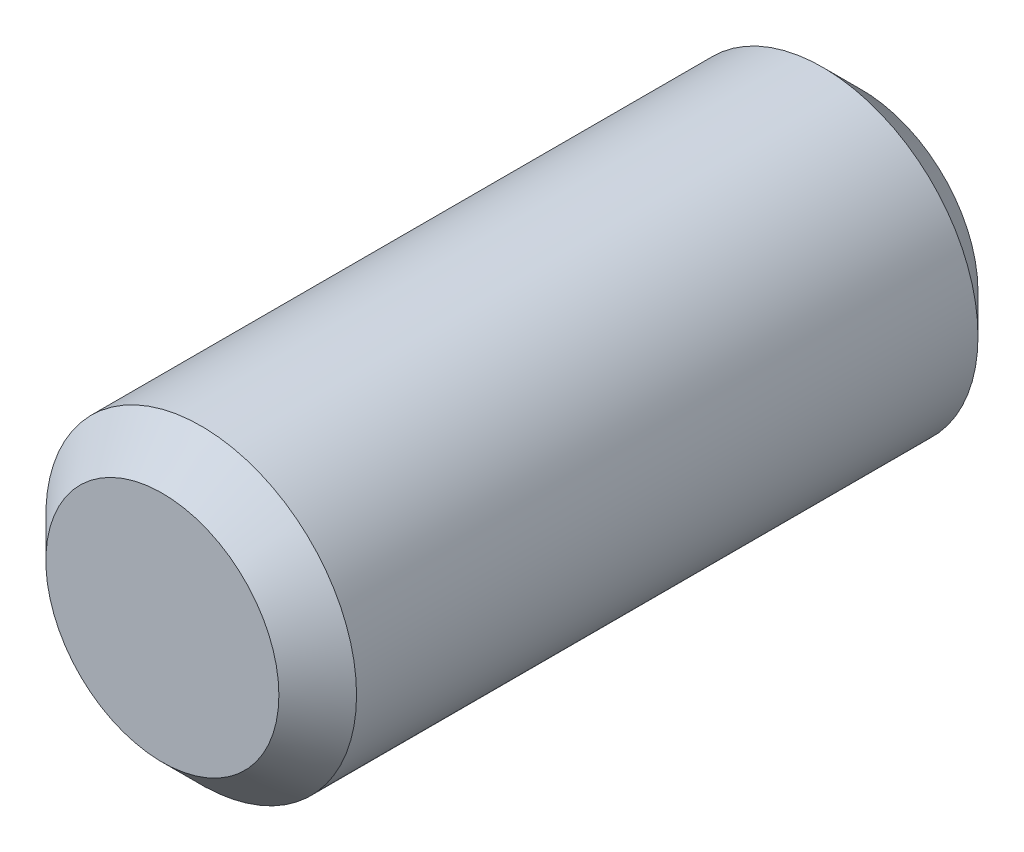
ISO-10303-21;
HEADER;
FILE_DESCRIPTION(('STEP AP214'),'2;1');
FILE_NAME('part.step','',(''),(''),'','','');
FILE_SCHEMA(('AUTOMOTIVE_DESIGN { 1 0 10303 214 1 1 1 1 }'));
ENDSEC;
DATA;
#1=APPLICATION_CONTEXT('core data for automotive mechanical design processes');
#2=APPLICATION_PROTOCOL_DEFINITION('international standard','automotive_design',2000,#1);
#3=PRODUCT_CONTEXT('',#1,'mechanical');
#4=PRODUCT('Part','Part','',(#3));
#5=PRODUCT_RELATED_PRODUCT_CATEGORY('part','',(#4));
#6=PRODUCT_DEFINITION_FORMATION('','',#4);
#7=PRODUCT_DEFINITION_CONTEXT('part definition',#1,'design');
#8=PRODUCT_DEFINITION('design','',#6,#7);
#9=PRODUCT_DEFINITION_SHAPE('','',#8);
#10=(LENGTH_UNIT() NAMED_UNIT(*) SI_UNIT(.MILLI.,.METRE.));
#11=(NAMED_UNIT(*) PLANE_ANGLE_UNIT() SI_UNIT($,.RADIAN.));
#12=(NAMED_UNIT(*) SI_UNIT($,.STERADIAN.) SOLID_ANGLE_UNIT());
#13=UNCERTAINTY_MEASURE_WITH_UNIT(LENGTH_MEASURE(1.E-05),#10,'distance_accuracy_value','');
#14=(GEOMETRIC_REPRESENTATION_CONTEXT(3) GLOBAL_UNCERTAINTY_ASSIGNED_CONTEXT((#13)) GLOBAL_UNIT_ASSIGNED_CONTEXT((#10,
#11,#12)) REPRESENTATION_CONTEXT('',''));
#15=CARTESIAN_POINT('',(0.,0.,0.));
#16=DIRECTION('',(0.,0.,1.));
#17=DIRECTION('',(1.,0.,0.));
#18=AXIS2_PLACEMENT_3D('',#15,#16,#17);
#19=CARTESIAN_POINT('',(0.,0.,9.));
#20=DIRECTION('',(0.,0.,-1.));
#21=DIRECTION('',(-1.,0.,0.));
#22=AXIS2_PLACEMENT_3D('',#19,#20,#21);
#23=CYLINDRICAL_SURFACE('',#22,2.);
#24=CARTESIAN_POINT('',(0.,0.,0.5));
#25=DIRECTION('',(0.,0.,1.));
#26=DIRECTION('',(1.,0.,0.));
#27=AXIS2_PLACEMENT_3D('',#24,#25,#26);
#28=CIRCLE('',#27,2.);
#29=CARTESIAN_POINT('',(2.,0.,0.5));
#30=VERTEX_POINT('',#29);
#31=EDGE_CURVE('E40',#30,#30,#28,.T.);
#32=ORIENTED_EDGE('',*,*,#31,.T.);
#33=EDGE_LOOP('',(#32));
#34=FACE_BOUND('',#33,.T.);
#35=CARTESIAN_POINT('',(0.,0.,8.5));
#36=DIRECTION('',(0.,0.,1.));
#37=DIRECTION('',(1.,0.,0.));
#38=AXIS2_PLACEMENT_3D('',#35,#36,#37);
#39=CIRCLE('',#38,2.);
#40=CARTESIAN_POINT('',(2.,0.,8.5));
#41=VERTEX_POINT('',#40);
#42=EDGE_CURVE('E44',#41,#41,#39,.F.);
#43=ORIENTED_EDGE('',*,*,#42,.T.);
#44=EDGE_LOOP('',(#43));
#45=FACE_BOUND('',#44,.T.);
#46=ADVANCED_FACE('F30',(#34,#45),#23,.T.);
#47=CARTESIAN_POINT('',(0.,0.,9.));
#48=DIRECTION('',(0.,0.,1.));
#49=DIRECTION('',(1.,0.,0.));
#50=AXIS2_PLACEMENT_3D('',#47,#48,#49);
#51=PLANE('',#50);
#52=CARTESIAN_POINT('',(0.,0.,9.));
#53=DIRECTION('',(0.,0.,1.));
#54=DIRECTION('',(1.,0.,0.));
#55=AXIS2_PLACEMENT_3D('',#52,#53,#54);
#56=CIRCLE('',#55,1.5);
#57=CARTESIAN_POINT('',(1.5,0.,9.));
#58=VERTEX_POINT('',#57);
#59=EDGE_CURVE('E10',#58,#58,#56,.T.);
#60=ORIENTED_EDGE('',*,*,#59,.T.);
#61=EDGE_LOOP('',(#60));
#62=FACE_BOUND('',#61,.T.);
#63=ADVANCED_FACE('F63',(#62),#51,.T.);
#64=CARTESIAN_POINT('',(0.,0.,0.));
#65=DIRECTION('',(0.,0.,1.));
#66=DIRECTION('',(1.,0.,0.));
#67=AXIS2_PLACEMENT_3D('',#64,#65,#66);
#68=PLANE('',#67);
#69=CARTESIAN_POINT('',(0.,0.,0.));
#70=DIRECTION('',(0.,0.,1.));
#71=DIRECTION('',(1.,0.,0.));
#72=AXIS2_PLACEMENT_3D('',#69,#70,#71);
#73=CIRCLE('',#72,1.5);
#74=CARTESIAN_POINT('',(1.5,0.,0.));
#75=VERTEX_POINT('',#74);
#76=EDGE_CURVE('E36',#75,#75,#73,.F.);
#77=ORIENTED_EDGE('',*,*,#76,.T.);
#78=EDGE_LOOP('',(#77));
#79=FACE_BOUND('',#78,.T.);
#80=ADVANCED_FACE('F59',(#79),#68,.F.);
#81=CARTESIAN_POINT('',(0.,0.,0.5));
#82=DIRECTION('',(0.,0.,1.));
#83=DIRECTION('',(1.,0.,0.));
#84=AXIS2_PLACEMENT_3D('',#81,#82,#83);
#85=CONICAL_SURFACE('',#84,2.,0.785398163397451);
#86=ORIENTED_EDGE('',*,*,#76,.F.);
#87=EDGE_LOOP('',(#86));
#88=FACE_BOUND('',#87,.T.);
#89=ORIENTED_EDGE('',*,*,#31,.F.);
#90=EDGE_LOOP('',(#89));
#91=FACE_BOUND('',#90,.T.);
#92=ADVANCED_FACE('F54',(#88,#91),#85,.T.);
#93=CARTESIAN_POINT('',(0.,0.,9.));
#94=DIRECTION('',(0.,0.,-1.));
#95=DIRECTION('',(-1.,0.,0.));
#96=AXIS2_PLACEMENT_3D('',#93,#94,#95);
#97=CONICAL_SURFACE('',#96,1.5,0.785398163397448);
#98=ORIENTED_EDGE('',*,*,#42,.F.);
#99=EDGE_LOOP('',(#98));
#100=FACE_BOUND('',#99,.T.);
#101=ORIENTED_EDGE('',*,*,#59,.F.);
#102=EDGE_LOOP('',(#101));
#103=FACE_BOUND('',#102,.T.);
#104=ADVANCED_FACE('F51',(#100,#103),#97,.T.);
#105=CLOSED_SHELL('',(#46,#63,#80,#92,#104));
#106=MANIFOLD_SOLID_BREP('B2',#105);
#107=ADVANCED_BREP_SHAPE_REPRESENTATION('',(#18,#106),#14);
#108=SHAPE_DEFINITION_REPRESENTATION(#9,#107);
ENDSEC;
END-ISO-10303-21;
